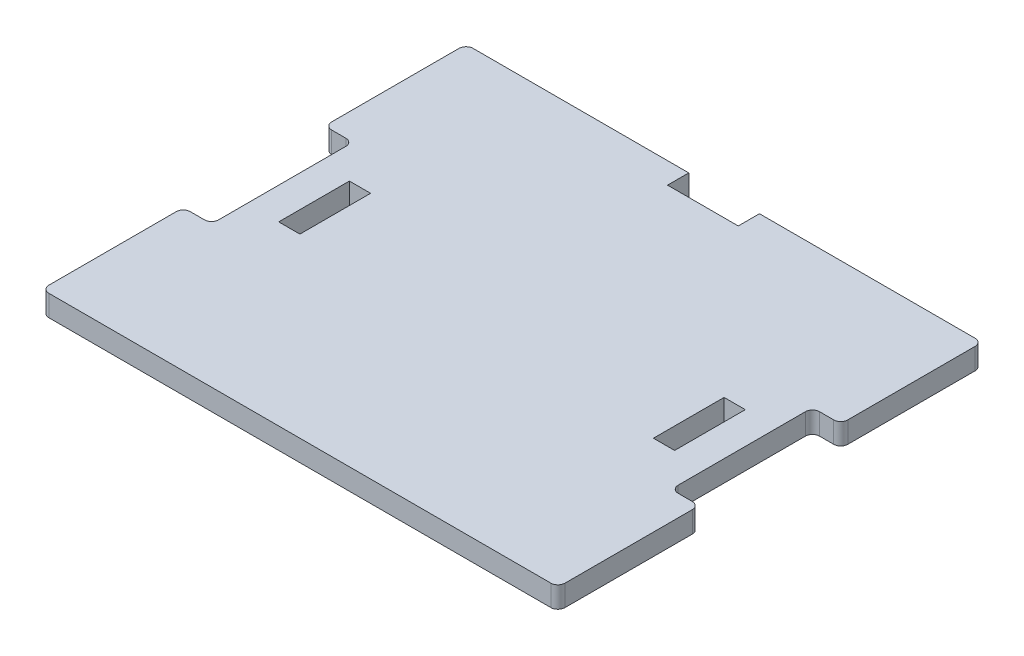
from build123d import *

# Parameters (mm, degrees)
BOSS_EXTRUDE1_DEPTH     = 6
FILLET1_R               = 2
CUT_EXTRUDE1_DEPTH      = 95.683683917
CUT_EXTRUDE1_DEPTH_BACK = 95.683683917
SKETCH2_W               = 6
SKETCH2_H               = 20
SKETCH3_W               = 20
SKETCH3_H               = 6
CUT_EXTRUDE2_DEPTH      = 95.683683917


with BuildPart() as part:
    # Sketch1 → Boss-Extrude1 (new body)
    with BuildSketch(Plane(origin=(0, 0, 0), x_dir=(1, 0, 0), z_dir=(0, 1, 0))):
        Polygon((65, 20), (65, -20), (73, -20), (73, -60), (-73, -60), (-73, -20), (-65, -20), (-65, 20), (-73, 20), (-73, 60), (73, 60), (73, 20), align=None)
    extrude(amount=BOSS_EXTRUDE1_DEPTH)

    # Fillet1
    fillet1_edges = [part.edges().sort_by_distance(p)[0] for p in [
        (65, 3, 20),
        (73, 3, 20),
        (73, 3, 60),
        (-73, 3, 60),
        (-73, 3, 20),
        (-65, 3, 20),
        (-65, 3, -20),
        (-73, 3, -20),
        (-73, 3, -60),
        (73, 3, -60),
        (73, 3, -20),
        (65, 3, -20),
    ]]
    fillet(fillet1_edges, radius=FILLET1_R)

    # Sketch2 → Cut-Extrude1 (cut, two sides: drawn at the far end of the back side and taken through both)
    with BuildSketch(Plane(origin=(0, 6, 0), x_dir=(1, 0, 0), z_dir=(0, 1, 0)).offset(-CUT_EXTRUDE1_DEPTH_BACK)):
        with Locations((53, 0)):
            Rectangle(SKETCH2_W, SKETCH2_H)
        with Locations((-53, 0)):
            Rectangle(SKETCH2_W, SKETCH2_H)
    extrude(amount=CUT_EXTRUDE1_DEPTH + CUT_EXTRUDE1_DEPTH_BACK, mode=Mode.SUBTRACT)

    # Sketch3 → Cut-Extrude2 (cut, through all)
    with BuildSketch(Plane(origin=(0, 6, 0), x_dir=(1, 0, 0), z_dir=(0, 1, 0))):
        with Locations((0, 57)):
            Rectangle(SKETCH3_W, SKETCH3_H)
    extrude(amount=-CUT_EXTRUDE2_DEPTH, mode=Mode.SUBTRACT)


solid = part.part
